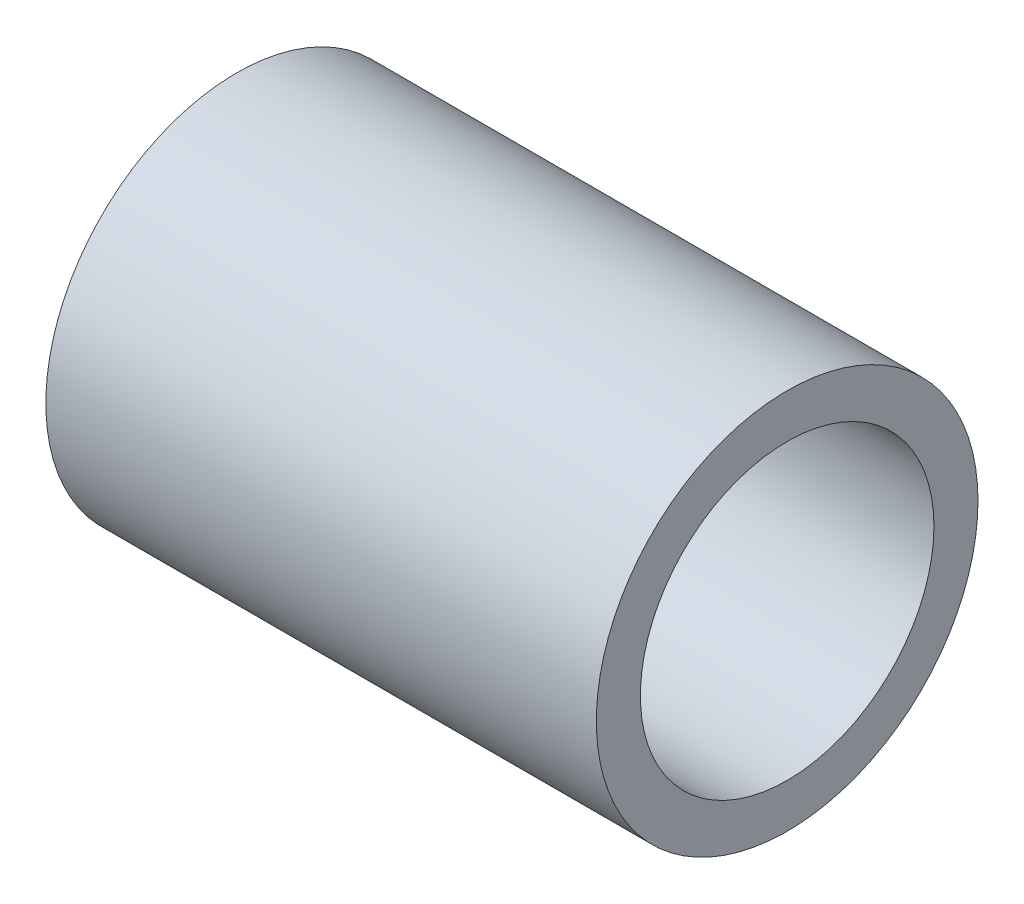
ISO-10303-21;
HEADER;
FILE_DESCRIPTION(('STEP AP214'),'2;1');
FILE_NAME('part.step','',(''),(''),'','','');
FILE_SCHEMA(('AUTOMOTIVE_DESIGN { 1 0 10303 214 1 1 1 1 }'));
ENDSEC;
DATA;
#1=APPLICATION_CONTEXT('core data for automotive mechanical design processes');
#2=APPLICATION_PROTOCOL_DEFINITION('international standard','automotive_design',2000,#1);
#3=PRODUCT_CONTEXT('',#1,'mechanical');
#4=PRODUCT('Part','Part','',(#3));
#5=PRODUCT_RELATED_PRODUCT_CATEGORY('part','',(#4));
#6=PRODUCT_DEFINITION_FORMATION('','',#4);
#7=PRODUCT_DEFINITION_CONTEXT('part definition',#1,'design');
#8=PRODUCT_DEFINITION('design','',#6,#7);
#9=PRODUCT_DEFINITION_SHAPE('','',#8);
#10=(LENGTH_UNIT() NAMED_UNIT(*) SI_UNIT(.MILLI.,.METRE.));
#11=(NAMED_UNIT(*) PLANE_ANGLE_UNIT() SI_UNIT($,.RADIAN.));
#12=(NAMED_UNIT(*) SI_UNIT($,.STERADIAN.) SOLID_ANGLE_UNIT());
#13=UNCERTAINTY_MEASURE_WITH_UNIT(LENGTH_MEASURE(1.E-05),#10,'distance_accuracy_value','');
#14=(GEOMETRIC_REPRESENTATION_CONTEXT(3) GLOBAL_UNCERTAINTY_ASSIGNED_CONTEXT((#13)) GLOBAL_UNIT_ASSIGNED_CONTEXT((#10,
#11,#12)) REPRESENTATION_CONTEXT('',''));
#15=CARTESIAN_POINT('',(0.,0.,0.));
#16=DIRECTION('',(0.,0.,1.));
#17=DIRECTION('',(1.,0.,0.));
#18=AXIS2_PLACEMENT_3D('',#15,#16,#17);
#19=CARTESIAN_POINT('',(47.625,0.,0.));
#20=DIRECTION('',(-1.,0.,0.));
#21=DIRECTION('',(0.,0.,1.));
#22=AXIS2_PLACEMENT_3D('',#19,#20,#21);
#23=CYLINDRICAL_SURFACE('',#22,12.7);
#24=CARTESIAN_POINT('',(47.625,0.,0.));
#25=DIRECTION('',(1.,0.,0.));
#26=DIRECTION('',(0.,0.,-1.));
#27=AXIS2_PLACEMENT_3D('',#24,#25,#26);
#28=CIRCLE('',#27,12.7);
#29=CARTESIAN_POINT('',(47.625,0.,-12.7));
#30=VERTEX_POINT('',#29);
#31=EDGE_CURVE('E42',#30,#30,#28,.T.);
#32=ORIENTED_EDGE('',*,*,#31,.T.);
#33=EDGE_LOOP('',(#32));
#34=FACE_BOUND('',#33,.T.);
#35=CARTESIAN_POINT('',(0.,0.,0.));
#36=DIRECTION('',(1.,0.,0.));
#37=DIRECTION('',(0.,0.,-1.));
#38=AXIS2_PLACEMENT_3D('',#35,#36,#37);
#39=CIRCLE('',#38,12.7);
#40=CARTESIAN_POINT('',(0.,0.,-12.7));
#41=VERTEX_POINT('',#40);
#42=EDGE_CURVE('E48',#41,#41,#39,.T.);
#43=ORIENTED_EDGE('',*,*,#42,.F.);
#44=EDGE_LOOP('',(#43));
#45=FACE_BOUND('',#44,.T.);
#46=ADVANCED_FACE('F35',(#34,#45),#23,.F.);
#47=CARTESIAN_POINT('',(47.625,0.,0.));
#48=DIRECTION('',(-1.,0.,0.));
#49=DIRECTION('',(0.,0.,1.));
#50=AXIS2_PLACEMENT_3D('',#47,#48,#49);
#51=CYLINDRICAL_SURFACE('',#50,16.51);
#52=CARTESIAN_POINT('',(47.625,0.,0.));
#53=DIRECTION('',(1.,0.,0.));
#54=DIRECTION('',(0.,0.,-1.));
#55=AXIS2_PLACEMENT_3D('',#52,#53,#54);
#56=CIRCLE('',#55,16.51);
#57=CARTESIAN_POINT('',(47.625,0.,-16.51));
#58=VERTEX_POINT('',#57);
#59=EDGE_CURVE('E10',#58,#58,#56,.T.);
#60=ORIENTED_EDGE('',*,*,#59,.F.);
#61=EDGE_LOOP('',(#60));
#62=FACE_BOUND('',#61,.T.);
#63=CARTESIAN_POINT('',(0.,0.,0.));
#64=DIRECTION('',(1.,0.,0.));
#65=DIRECTION('',(0.,0.,-1.));
#66=AXIS2_PLACEMENT_3D('',#63,#64,#65);
#67=CIRCLE('',#66,16.51);
#68=CARTESIAN_POINT('',(0.,0.,-16.51));
#69=VERTEX_POINT('',#68);
#70=EDGE_CURVE('E38',#69,#69,#67,.T.);
#71=ORIENTED_EDGE('',*,*,#70,.T.);
#72=EDGE_LOOP('',(#71));
#73=FACE_BOUND('',#72,.T.);
#74=ADVANCED_FACE('F55',(#62,#73),#51,.T.);
#75=CARTESIAN_POINT('',(47.625,0.,0.));
#76=DIRECTION('',(1.,0.,0.));
#77=DIRECTION('',(0.,0.,-1.));
#78=AXIS2_PLACEMENT_3D('',#75,#76,#77);
#79=PLANE('',#78);
#80=ORIENTED_EDGE('',*,*,#31,.F.);
#81=EDGE_LOOP('',(#80));
#82=FACE_BOUND('',#81,.T.);
#83=ORIENTED_EDGE('',*,*,#59,.T.);
#84=EDGE_LOOP('',(#83));
#85=FACE_BOUND('',#84,.T.);
#86=ADVANCED_FACE('F59',(#82,#85),#79,.T.);
#87=CARTESIAN_POINT('',(0.,0.,0.));
#88=DIRECTION('',(1.,0.,0.));
#89=DIRECTION('',(0.,0.,-1.));
#90=AXIS2_PLACEMENT_3D('',#87,#88,#89);
#91=PLANE('',#90);
#92=ORIENTED_EDGE('',*,*,#42,.T.);
#93=EDGE_LOOP('',(#92));
#94=FACE_BOUND('',#93,.T.);
#95=ORIENTED_EDGE('',*,*,#70,.F.);
#96=EDGE_LOOP('',(#95));
#97=FACE_BOUND('',#96,.T.);
#98=ADVANCED_FACE('F57',(#94,#97),#91,.F.);
#99=CLOSED_SHELL('',(#46,#74,#86,#98));
#100=MANIFOLD_SOLID_BREP('B2',#99);
#101=ADVANCED_BREP_SHAPE_REPRESENTATION('',(#18,#100),#14);
#102=SHAPE_DEFINITION_REPRESENTATION(#9,#101);
ENDSEC;
END-ISO-10303-21;
